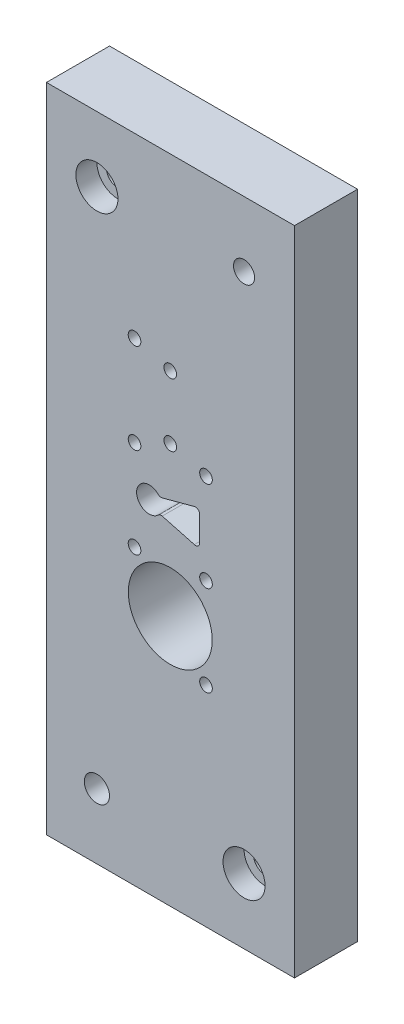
from build123d import *

# Parameters (mm, degrees)
ESQUISSE1_W                                     = 59
ESQUISSE1_H                                     = 155
ESQUISSE1_R                                     = 3.0035
ESQUISSE1_R_2                                   = 2.5035
EXTRUSION1_DEPTH                                = 15
CHAMBRAGE_POUR_VIS_T_TE_CYLINDRIQUE_D           = 5.5
CHAMBRAGE_POUR_VIS_T_TE_CYLINDRIQUE_CBORE_D     = 10
CHAMBRAGE_POUR_VIS_T_TE_CYLINDRIQUE_CBORE_DEPTH = 5
ESQUISSE4_R                                     = 1.5035
ESQUISSE4_R_2                                   = 9.98
ENL_V_MAT_EXTRU_2_DEPTH                         = 85.270398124


with BuildPart() as part:
    # Esquisse1 → Extrusion1 (new body)
    with BuildSketch(Plane.XY):
        Rectangle(ESQUISSE1_W, ESQUISSE1_H)
        with Locations((-17.5, -62)):
            Circle(ESQUISSE1_R, mode=Mode.SUBTRACT)
        with Locations((17.5, 62)):
            Circle(ESQUISSE1_R_2, mode=Mode.SUBTRACT)
    extrude(amount=EXTRUSION1_DEPTH)

    # Chambrage pour vis _ t_te cylindrique (through all)
    with Locations(Plane.XY.offset(15)):
        with Locations((-17.5, 62), (17.5, -62)):
            CounterBoreHole(CHAMBRAGE_POUR_VIS_T_TE_CYLINDRIQUE_D / 2, CHAMBRAGE_POUR_VIS_T_TE_CYLINDRIQUE_CBORE_D / 2, CHAMBRAGE_POUR_VIS_T_TE_CYLINDRIQUE_CBORE_DEPTH)

    # Esquisse4 → Enl_v. mat.-Extru.2 (cut, through all)
    with BuildSketch(Plane.XY.offset(15)):
        with Locations((-0.05, 32.8)):
            Circle(ESQUISSE4_R)
        with Locations((-0.05, 17.8)):
            Circle(ESQUISSE4_R)
        with Locations((-8.55, 35.267948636)):
            Circle(ESQUISSE4_R)
        with Locations((8.45, 15.332051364)):
            Circle(ESQUISSE4_R)
        with Locations((-8.55, 13.767948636)):
            Circle(ESQUISSE4_R)
        with Locations((8.45, -6.167948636)):
            Circle(ESQUISSE4_R)
        with Locations((-8.55, -7.732051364)):
            Circle(ESQUISSE4_R)
        with Locations((8.45, -27.667948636)):
            Circle(ESQUISSE4_R)
        with Locations((-0.05, -17.7)):
            Circle(ESQUISSE4_R_2)
        with BuildLine():
            Line((5.688592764, 7.723026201), (-1.965342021, 5.672160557))
            ThreePointArc((-1.965342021, 5.672160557), (-2.47780373, 5.672160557), (-2.921608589, 5.928391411))
            ThreePointArc((-2.921608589, 5.928391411), (-8.06, 3.8), (-2.921608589, 1.671608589))
            ThreePointArc((-2.921608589, 1.671608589), (-2.47780373, 1.927839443), (-1.965342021, 1.927839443))
            Line((-1.965342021, 1.927839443), (5.688592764, -0.123026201))
            ThreePointArc((5.688592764, -0.123026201), (6.564849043, 0.05127201), (6.96, 0.852558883))
            Line((6.96, 0.852558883), (6.96, 6.747441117))
            ThreePointArc((6.96, 6.747441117), (6.564849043, 7.54872799), (5.688592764, 7.723026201))
        make_face()
    extrude(amount=-ENL_V_MAT_EXTRU_2_DEPTH, mode=Mode.SUBTRACT)


solid = part.part
